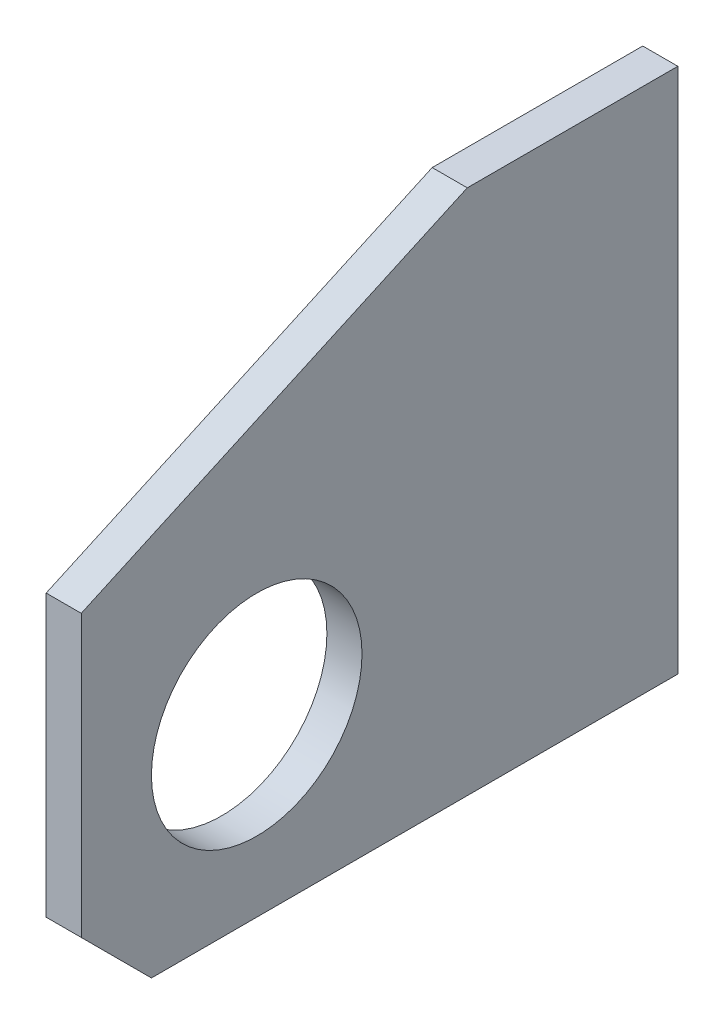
ISO-10303-21;
HEADER;
FILE_DESCRIPTION(('STEP AP214'),'2;1');
FILE_NAME('part.step','',(''),(''),'','','');
FILE_SCHEMA(('AUTOMOTIVE_DESIGN { 1 0 10303 214 1 1 1 1 }'));
ENDSEC;
DATA;
#1=APPLICATION_CONTEXT('core data for automotive mechanical design processes');
#2=APPLICATION_PROTOCOL_DEFINITION('international standard','automotive_design',2000,#1);
#3=PRODUCT_CONTEXT('',#1,'mechanical');
#4=PRODUCT('Part','Part','',(#3));
#5=PRODUCT_RELATED_PRODUCT_CATEGORY('part','',(#4));
#6=PRODUCT_DEFINITION_FORMATION('','',#4);
#7=PRODUCT_DEFINITION_CONTEXT('part definition',#1,'design');
#8=PRODUCT_DEFINITION('design','',#6,#7);
#9=PRODUCT_DEFINITION_SHAPE('','',#8);
#10=(LENGTH_UNIT() NAMED_UNIT(*) SI_UNIT(.MILLI.,.METRE.));
#11=(NAMED_UNIT(*) PLANE_ANGLE_UNIT() SI_UNIT($,.RADIAN.));
#12=(NAMED_UNIT(*) SI_UNIT($,.STERADIAN.) SOLID_ANGLE_UNIT());
#13=UNCERTAINTY_MEASURE_WITH_UNIT(LENGTH_MEASURE(1.E-05),#10,'distance_accuracy_value','');
#14=(GEOMETRIC_REPRESENTATION_CONTEXT(3) GLOBAL_UNCERTAINTY_ASSIGNED_CONTEXT((#13)) GLOBAL_UNIT_ASSIGNED_CONTEXT((#10,
#11,#12)) REPRESENTATION_CONTEXT('',''));
#15=CARTESIAN_POINT('',(0.,0.,0.));
#16=DIRECTION('',(0.,0.,1.));
#17=DIRECTION('',(1.,0.,0.));
#18=AXIS2_PLACEMENT_3D('',#15,#16,#17);
#19=CARTESIAN_POINT('',(10.,150.,60.));
#20=DIRECTION('',(0.,-1.,0.));
#21=DIRECTION('',(0.,0.,-1.));
#22=AXIS2_PLACEMENT_3D('',#19,#20,#21);
#23=PLANE('',#22);
#24=DIRECTION('',(0.,0.,1.));
#25=VECTOR('',#24,1.);
#26=CARTESIAN_POINT('',(0.,150.,60.));
#27=LINE('',#26,#25);
#28=CARTESIAN_POINT('',(0.,150.,0.));
#29=VERTEX_POINT('',#28);
#30=CARTESIAN_POINT('',(0.,150.,60.));
#31=VERTEX_POINT('',#30);
#32=EDGE_CURVE('E107',#29,#31,#27,.T.);
#33=ORIENTED_EDGE('',*,*,#32,.T.);
#34=DIRECTION('',(-1.,0.,0.));
#35=VECTOR('',#34,1.);
#36=CARTESIAN_POINT('',(10.,150.,60.));
#37=LINE('',#36,#35);
#38=CARTESIAN_POINT('',(10.,150.,60.));
#39=VERTEX_POINT('',#38);
#40=EDGE_CURVE('E89',#39,#31,#37,.T.);
#41=ORIENTED_EDGE('',*,*,#40,.F.);
#42=DIRECTION('',(0.,0.,1.));
#43=VECTOR('',#42,1.);
#44=CARTESIAN_POINT('',(10.,150.,60.));
#45=LINE('',#44,#43);
#46=CARTESIAN_POINT('',(10.,150.,0.));
#47=VERTEX_POINT('',#46);
#48=EDGE_CURVE('E95',#47,#39,#45,.T.);
#49=ORIENTED_EDGE('',*,*,#48,.F.);
#50=DIRECTION('',(-1.,0.,0.));
#51=VECTOR('',#50,1.);
#52=CARTESIAN_POINT('',(10.,150.,0.));
#53=LINE('',#52,#51);
#54=EDGE_CURVE('E118',#47,#29,#53,.T.);
#55=ORIENTED_EDGE('',*,*,#54,.T.);
#56=EDGE_LOOP('',(#33,#41,#49,#55));
#57=FACE_BOUND('',#56,.T.);
#58=ADVANCED_FACE('F32',(#57),#23,.F.);
#59=CARTESIAN_POINT('',(10.,100.,170.));
#60=DIRECTION('',(0.,-0.910366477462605,-0.413802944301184));
#61=DIRECTION('',(0.,0.413802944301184,-0.910366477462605));
#62=AXIS2_PLACEMENT_3D('',#59,#60,#61);
#63=PLANE('',#62);
#64=DIRECTION('',(0.,-0.413802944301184,0.910366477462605));
#65=VECTOR('',#64,1.);
#66=CARTESIAN_POINT('',(0.,100.,170.));
#67=LINE('',#66,#65);
#68=CARTESIAN_POINT('',(0.,100.,170.));
#69=VERTEX_POINT('',#68);
#70=EDGE_CURVE('E125',#31,#69,#67,.T.);
#71=ORIENTED_EDGE('',*,*,#70,.T.);
#72=DIRECTION('',(-1.,0.,0.));
#73=VECTOR('',#72,1.);
#74=CARTESIAN_POINT('',(10.,100.,170.));
#75=LINE('',#74,#73);
#76=CARTESIAN_POINT('',(10.,100.,170.));
#77=VERTEX_POINT('',#76);
#78=EDGE_CURVE('E92',#77,#69,#75,.T.);
#79=ORIENTED_EDGE('',*,*,#78,.F.);
#80=DIRECTION('',(0.,-0.413802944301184,0.910366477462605));
#81=VECTOR('',#80,1.);
#82=CARTESIAN_POINT('',(10.,100.,170.));
#83=LINE('',#82,#81);
#84=EDGE_CURVE('E85',#39,#77,#83,.T.);
#85=ORIENTED_EDGE('',*,*,#84,.F.);
#86=ORIENTED_EDGE('',*,*,#40,.T.);
#87=EDGE_LOOP('',(#71,#79,#85,#86));
#88=FACE_BOUND('',#87,.T.);
#89=ADVANCED_FACE('F87',(#88),#63,.F.);
#90=CARTESIAN_POINT('',(10.,0.,170.));
#91=DIRECTION('',(0.,0.,-1.));
#92=DIRECTION('',(-1.,0.,0.));
#93=AXIS2_PLACEMENT_3D('',#90,#91,#92);
#94=PLANE('',#93);
#95=DIRECTION('',(0.,-1.,0.));
#96=VECTOR('',#95,1.);
#97=CARTESIAN_POINT('',(0.,0.,170.));
#98=LINE('',#97,#96);
#99=CARTESIAN_POINT('',(0.,20.0000000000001,170.));
#100=VERTEX_POINT('',#99);
#101=EDGE_CURVE('E123',#69,#100,#98,.T.);
#102=ORIENTED_EDGE('',*,*,#101,.T.);
#103=DIRECTION('',(1.,0.,0.));
#104=VECTOR('',#103,1.);
#105=CARTESIAN_POINT('',(10.,20.0000000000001,170.));
#106=LINE('',#105,#104);
#107=CARTESIAN_POINT('',(10.,20.0000000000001,170.));
#108=VERTEX_POINT('',#107);
#109=EDGE_CURVE('E40',#100,#108,#106,.T.);
#110=ORIENTED_EDGE('',*,*,#109,.T.);
#111=DIRECTION('',(0.,-1.,0.));
#112=VECTOR('',#111,1.);
#113=CARTESIAN_POINT('',(10.,0.,170.));
#114=LINE('',#113,#112);
#115=EDGE_CURVE('E94',#77,#108,#114,.T.);
#116=ORIENTED_EDGE('',*,*,#115,.F.);
#117=ORIENTED_EDGE('',*,*,#78,.T.);
#118=EDGE_LOOP('',(#102,#110,#116,#117));
#119=FACE_BOUND('',#118,.T.);
#120=ADVANCED_FACE('F162',(#119),#94,.F.);
#121=CARTESIAN_POINT('',(10.,0.,0.));
#122=DIRECTION('',(0.,1.,0.));
#123=DIRECTION('',(0.,0.,1.));
#124=AXIS2_PLACEMENT_3D('',#121,#122,#123);
#125=PLANE('',#124);
#126=DIRECTION('',(0.,0.,-1.));
#127=VECTOR('',#126,1.);
#128=CARTESIAN_POINT('',(10.,0.,0.));
#129=LINE('',#128,#127);
#130=CARTESIAN_POINT('',(10.,0.,150.));
#131=VERTEX_POINT('',#130);
#132=CARTESIAN_POINT('',(10.,0.,0.));
#133=VERTEX_POINT('',#132);
#134=EDGE_CURVE('E130',#131,#133,#129,.T.);
#135=ORIENTED_EDGE('',*,*,#134,.F.);
#136=DIRECTION('',(-1.,0.,0.));
#137=VECTOR('',#136,1.);
#138=CARTESIAN_POINT('',(10.,0.,150.));
#139=LINE('',#138,#137);
#140=CARTESIAN_POINT('',(0.,0.,150.));
#141=VERTEX_POINT('',#140);
#142=EDGE_CURVE('E108',#131,#141,#139,.T.);
#143=ORIENTED_EDGE('',*,*,#142,.T.);
#144=DIRECTION('',(0.,0.,-1.));
#145=VECTOR('',#144,1.);
#146=CARTESIAN_POINT('',(0.,0.,0.));
#147=LINE('',#146,#145);
#148=CARTESIAN_POINT('',(0.,0.,0.));
#149=VERTEX_POINT('',#148);
#150=EDGE_CURVE('E121',#141,#149,#147,.T.);
#151=ORIENTED_EDGE('',*,*,#150,.T.);
#152=DIRECTION('',(-1.,0.,0.));
#153=VECTOR('',#152,1.);
#154=CARTESIAN_POINT('',(10.,0.,0.));
#155=LINE('',#154,#153);
#156=EDGE_CURVE('E112',#133,#149,#155,.T.);
#157=ORIENTED_EDGE('',*,*,#156,.F.);
#158=EDGE_LOOP('',(#135,#143,#151,#157));
#159=FACE_BOUND('',#158,.T.);
#160=ADVANCED_FACE('F155',(#159),#125,.F.);
#161=CARTESIAN_POINT('',(10.,150.,0.));
#162=DIRECTION('',(0.,0.,1.));
#163=DIRECTION('',(0.,-1.,0.));
#164=AXIS2_PLACEMENT_3D('',#161,#162,#163);
#165=PLANE('',#164);
#166=DIRECTION('',(0.,1.,0.));
#167=VECTOR('',#166,1.);
#168=CARTESIAN_POINT('',(0.,150.,0.));
#169=LINE('',#168,#167);
#170=EDGE_CURVE('E104',#149,#29,#169,.T.);
#171=ORIENTED_EDGE('',*,*,#170,.T.);
#172=ORIENTED_EDGE('',*,*,#54,.F.);
#173=DIRECTION('',(0.,1.,0.));
#174=VECTOR('',#173,1.);
#175=CARTESIAN_POINT('',(10.,150.,0.));
#176=LINE('',#175,#174);
#177=EDGE_CURVE('E100',#133,#47,#176,.T.);
#178=ORIENTED_EDGE('',*,*,#177,.F.);
#179=ORIENTED_EDGE('',*,*,#156,.T.);
#180=EDGE_LOOP('',(#171,#172,#178,#179));
#181=FACE_BOUND('',#180,.T.);
#182=ADVANCED_FACE('F148',(#181),#165,.F.);
#183=CARTESIAN_POINT('',(10.,0.,0.));
#184=DIRECTION('',(-1.,0.,0.));
#185=DIRECTION('',(0.,0.,1.));
#186=AXIS2_PLACEMENT_3D('',#183,#184,#185);
#187=PLANE('',#186);
#188=CARTESIAN_POINT('',(10.,50.,120.));
#189=DIRECTION('',(1.,0.,0.));
#190=DIRECTION('',(0.,0.,-1.));
#191=AXIS2_PLACEMENT_3D('',#188,#189,#190);
#192=CIRCLE('',#191,30.);
#193=CARTESIAN_POINT('',(10.,50.,90.));
#194=VERTEX_POINT('',#193);
#195=EDGE_CURVE('E133',#194,#194,#192,.T.);
#196=ORIENTED_EDGE('',*,*,#195,.F.);
#197=EDGE_LOOP('',(#196));
#198=FACE_BOUND('',#197,.T.);
#199=ORIENTED_EDGE('',*,*,#115,.T.);
#200=DIRECTION('',(0.,0.70710678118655,0.707106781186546));
#201=VECTOR('',#200,1.);
#202=CARTESIAN_POINT('',(10.,0.,150.));
#203=LINE('',#202,#201);
#204=EDGE_CURVE('E11',#108,#131,#203,.F.);
#205=ORIENTED_EDGE('',*,*,#204,.T.);
#206=ORIENTED_EDGE('',*,*,#134,.T.);
#207=ORIENTED_EDGE('',*,*,#177,.T.);
#208=ORIENTED_EDGE('',*,*,#48,.T.);
#209=ORIENTED_EDGE('',*,*,#84,.T.);
#210=EDGE_LOOP('',(#199,#205,#206,#207,#208,#209));
#211=FACE_BOUND('',#210,.T.);
#212=ADVANCED_FACE('F98',(#198,#211),#187,.F.);
#213=CARTESIAN_POINT('',(0.,0.,0.));
#214=DIRECTION('',(-1.,0.,0.));
#215=DIRECTION('',(0.,0.,1.));
#216=AXIS2_PLACEMENT_3D('',#213,#214,#215);
#217=PLANE('',#216);
#218=CARTESIAN_POINT('',(0.,50.,120.));
#219=DIRECTION('',(1.,0.,0.));
#220=DIRECTION('',(0.,0.,-1.));
#221=AXIS2_PLACEMENT_3D('',#218,#219,#220);
#222=CIRCLE('',#221,30.);
#223=CARTESIAN_POINT('',(0.,50.,90.));
#224=VERTEX_POINT('',#223);
#225=EDGE_CURVE('E128',#224,#224,#222,.T.);
#226=ORIENTED_EDGE('',*,*,#225,.T.);
#227=EDGE_LOOP('',(#226));
#228=FACE_BOUND('',#227,.T.);
#229=ORIENTED_EDGE('',*,*,#150,.F.);
#230=DIRECTION('',(0.,-0.70710678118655,-0.707106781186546));
#231=VECTOR('',#230,1.);
#232=CARTESIAN_POINT('',(0.,-75.,75.0000000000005));
#233=LINE('',#232,#231);
#234=EDGE_CURVE('E54',#141,#100,#233,.F.);
#235=ORIENTED_EDGE('',*,*,#234,.T.);
#236=ORIENTED_EDGE('',*,*,#101,.F.);
#237=ORIENTED_EDGE('',*,*,#70,.F.);
#238=ORIENTED_EDGE('',*,*,#32,.F.);
#239=ORIENTED_EDGE('',*,*,#170,.F.);
#240=EDGE_LOOP('',(#229,#235,#236,#237,#238,#239));
#241=FACE_BOUND('',#240,.T.);
#242=ADVANCED_FACE('F139',(#228,#241),#217,.T.);
#243=CARTESIAN_POINT('',(0.,50.,120.));
#244=DIRECTION('',(1.,0.,0.));
#245=DIRECTION('',(0.,0.,-1.));
#246=AXIS2_PLACEMENT_3D('',#243,#244,#245);
#247=CYLINDRICAL_SURFACE('',#246,30.);
#248=ORIENTED_EDGE('',*,*,#225,.F.);
#249=EDGE_LOOP('',(#248));
#250=FACE_BOUND('',#249,.T.);
#251=ORIENTED_EDGE('',*,*,#195,.T.);
#252=EDGE_LOOP('',(#251));
#253=FACE_BOUND('',#252,.T.);
#254=ADVANCED_FACE('F141',(#250,#253),#247,.F.);
#255=CARTESIAN_POINT('',(10.,0.,150.));
#256=DIRECTION('',(0.,0.707106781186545,-0.707106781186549));
#257=DIRECTION('',(-1.,0.,0.));
#258=AXIS2_PLACEMENT_3D('',#255,#256,#257);
#259=PLANE('',#258);
#260=ORIENTED_EDGE('',*,*,#204,.F.);
#261=ORIENTED_EDGE('',*,*,#109,.F.);
#262=ORIENTED_EDGE('',*,*,#234,.F.);
#263=ORIENTED_EDGE('',*,*,#142,.F.);
#264=EDGE_LOOP('',(#260,#261,#262,#263));
#265=FACE_BOUND('',#264,.T.);
#266=ADVANCED_FACE('F34',(#265),#259,.F.);
#267=CLOSED_SHELL('',(#58,#89,#120,#160,#182,#212,#242,#254,#266));
#268=MANIFOLD_SOLID_BREP('B2',#267);
#269=ADVANCED_BREP_SHAPE_REPRESENTATION('',(#18,#268),#14);
#270=SHAPE_DEFINITION_REPRESENTATION(#9,#269);
ENDSEC;
END-ISO-10303-21;
